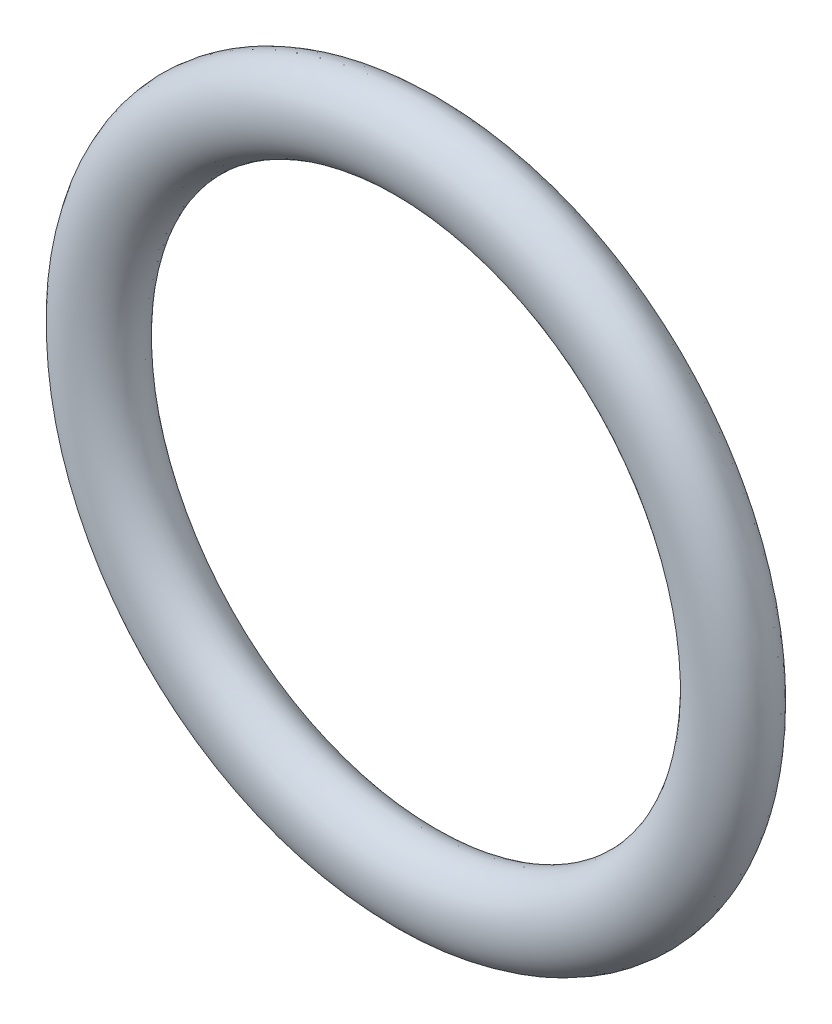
from build123d import *

# Parameters (mm, degrees)
ESQUISSE1_RX = 1.2
ESQUISSE1_RY = 0.95


with BuildPart() as part:
    # Esquisse1 → Base-R_volution (revolve)
    with BuildSketch(Plane(origin=(0, 0, 0), x_dir=(0, 0, -1), z_dir=(1, 0, 0))):
        with Locations(Location((0.95, 9.2), (0, 0, 90))):
            Ellipse(ESQUISSE1_RX, ESQUISSE1_RY)
    revolve(axis=Axis((0, 0, 0), (0, 0, -1)))


solid = part.part
